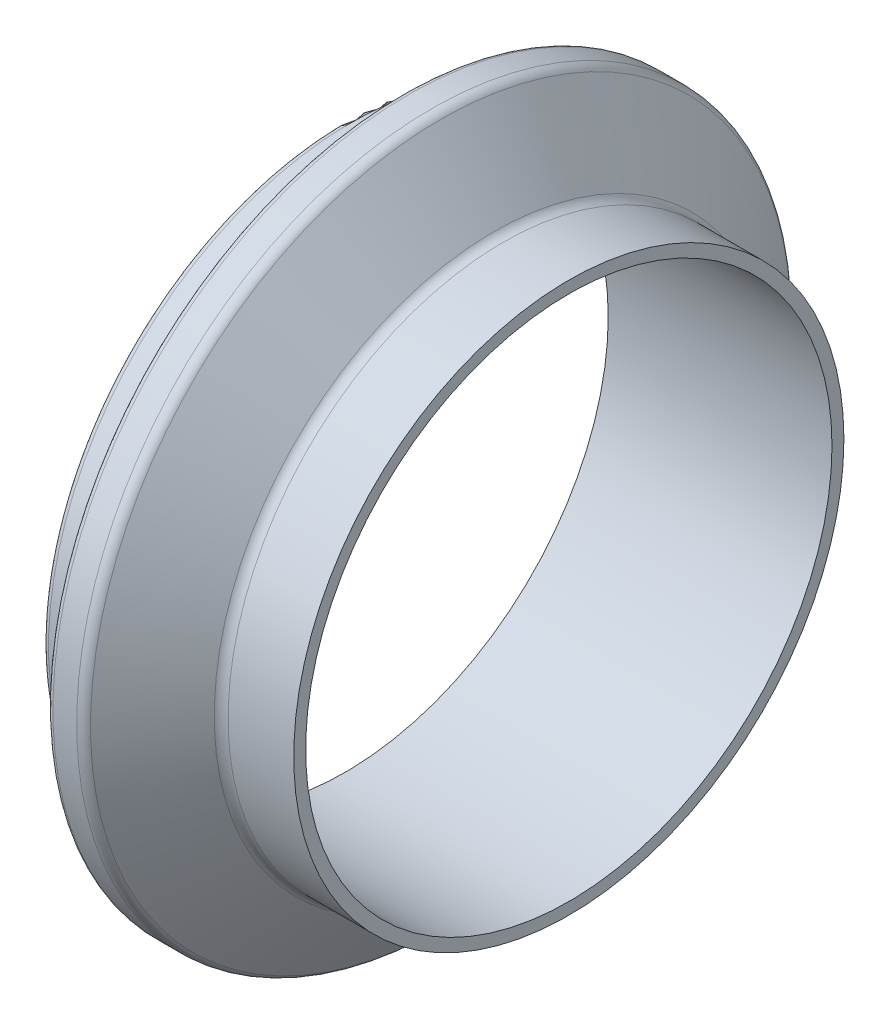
from build123d import *


with BuildPart() as part:
    # Sketch1 → Revolve1 (revolve)
    with BuildSketch(Plane.XY, mode=Mode.PRIVATE) as revolve1_sk:
        with BuildLine():
            Line((0, 36.449), (-30.988, 36.449))
            Line((-30.988, 36.449), (-30.988, 41.0718))
            ThreePointArc((-30.988, 41.0718), (-30.749936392, 41.646536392), (-30.1752, 41.8846))
            Line((-30.1752, 41.8846), (-23.9268, 41.8846))
            ThreePointArc((-23.9268, 41.8846), (-23.352063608, 42.122663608), (-23.114, 42.6974))
            Line((-23.114, 42.6974), (-23.114, 48.3362))
            ThreePointArc((-23.114, 48.3362), (-22.875936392, 48.910936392), (-22.3012, 49.149))
            Line((-22.3012, 49.149), (-19.009630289, 49.149))
            ThreePointArc((-19.009630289, 49.149), (-18.295624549, 48.980873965), (-17.731653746, 48.5118244))
            Line((-17.731653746, 48.5118244), (-10.365927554, 38.7371756))
            ThreePointArc((-10.365927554, 38.7371756), (-9.801956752, 38.268126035), (-9.087951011, 38.1))
            Line((-9.087951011, 38.1), (0, 38.1))
            Line((0, 38.1), (0, 36.449))
        make_face()
    revolve(revolve1_sk.sketch.rotate(Axis((0, 0, 0), (-1, 0, 0)), 90), axis=Axis((0, 0, 0), (-1, 0, 0)))


solid = part.part
